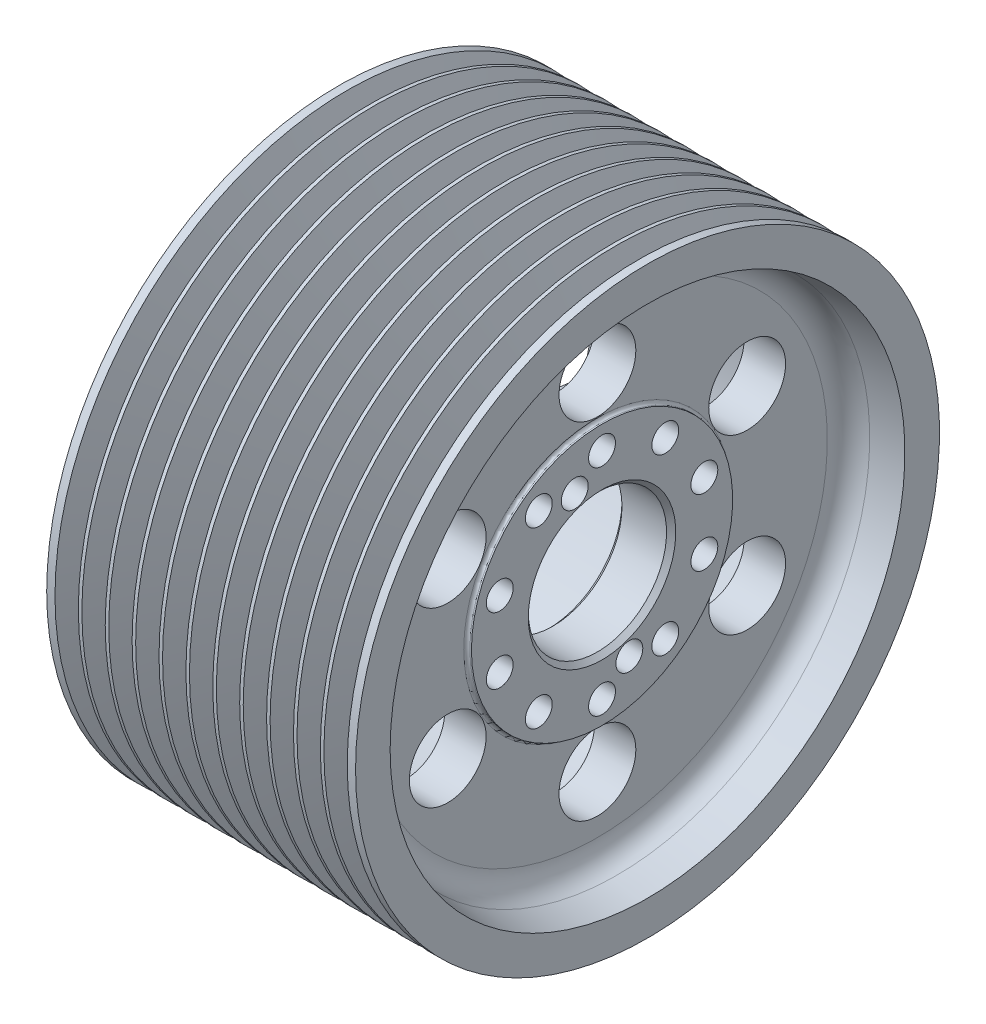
from build123d import *

# Parameters (mm, degrees)
LINEARES_MUSTER1_COUNT             = 11
LINEARES_MUSTER1_PITCH             = 17.5
F_17_5_17_5_DURCHMESSER_BOHRUNG1_D = 17.5
KREISMUSTER1_COUNT                 = 10
SCHNITT_LINEAR_AUSTRAGEN1_REACH    = 319.11
SKIZZE5_R                          = 25
KREISMUSTER2_COUNT                 = 6
FASE1_SIZE                         = 3
M16_GEWINDEBOHRUNG1_D              = 14
KREISMUSTER3_COUNT                 = 2
VERRUNDUNG1_R                      = 1


with BuildPart() as part:
    # Skizze1 → Rotation1 (revolve)
    with BuildSketch(Plane.XY, mode=Mode.PRIVATE) as rotation1_sk:
        with BuildLine():
            Line((0, 167.5), (0, 190))
            Line((0, 190), (201, 190))
            Line((201, 190), (201, 167.5))
            Line((201, 167.5), (181.12597769, 164.451837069))
            ThreePointArc((181.12597769, 164.451837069), (172.017769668, 159.394798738), (168.4, 149.625211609))
            Line((168.4, 149.625211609), (168.4, 87))
            ThreePointArc((168.4, 87), (168.985786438, 85.585786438), (170.4, 85))
            Line((170.4, 85), (171.4, 85))
            Line((171.4, 85), (171.4, 45))
            Line((171.4, 45), (136.4, 45))
            Line((136.4, 45), (136.4, 85))
            Line((136.4, 85), (139.4, 85))
            ThreePointArc((139.4, 85), (140.814213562, 85.585786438), (141.4, 87))
            Line((141.4, 87), (141.4, 147.953615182))
            ThreePointArc((141.4, 147.953615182), (137.168172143, 158.3961469), (126.86047084, 162.946545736))
            Line((126.86047084, 162.946545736), (60, 165))
            Line((60, 165), (60, 167.5))
            Line((60, 167.5), (0, 167.5))
        make_face()
    revolve(rotation1_sk.sketch.rotate(Axis((0, 0, 0), (1, 0, 0)), 90), axis=Axis((0, 0, 0), (1, 0, 0)))

    # Skizze2 → Schnitt-Rotation1 (revolve, cut)
    with BuildSketch(Plane.XY, mode=Mode.PRIVATE) as schnitt_rotation1_sk:
        Polygon((185.932347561, 174.8), (190.067652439, 174.8), (195.6, 190), (180.4, 190), align=None)
    schnitt_rotation1 = revolve(schnitt_rotation1_sk.sketch.rotate(Axis((0, 0, 0), (1, 0, 0)), 90), axis=Axis((0, 0, 0), (1, 0, 0)), mode=Mode.SUBTRACT)

    # Lineares Muster1: Schnitt-Rotation1 ×11
    with Locations(*[(-i * LINEARES_MUSTER1_PITCH, 0, 0) for i in range(1, LINEARES_MUSTER1_COUNT)]):
        add(schnitt_rotation1, mode=Mode.SUBTRACT)

    # 17.5 _17.5_ Durchmesser Bohrung1 (through all)
    with Locations(Plane(origin=(171.4, 0, 0), x_dir=(0, 0, -1), z_dir=(1, 0, 0))):
        with Locations((0, 70)):
            f_17_5_17_5_durchmesser_bohrung1 = Hole(F_17_5_17_5_DURCHMESSER_BOHRUNG1_D / 2)

    # Kreismuster1: 17.5 _17.5_ Durchmesser Bohrung1 ×10 about axis
    kreismuster1_axis = Axis((0, 0, 0), (-1, 0, 0))
    for i in range(1, KREISMUSTER1_COUNT):
        add(f_17_5_17_5_durchmesser_bohrung1.rotate(kreismuster1_axis, i * 360 / KREISMUSTER1_COUNT), mode=Mode.SUBTRACT)

    # Skizze5 → Schnitt-Linear austragen1 (cut, up to next)
    with BuildSketch(Plane(origin=(168.4, 0, 0), x_dir=(0, 0, -1), z_dir=(1, 0, 0)), mode=Mode.PRIVATE) as schnitt_linear_austragen1_sk1:
        with Locations((0, 112.5)):
            Circle(SKIZZE5_R)
    schnitt_linear_austragen1_tool1 = extrude(schnitt_linear_austragen1_sk1.sketch, amount=-SCHNITT_LINEAR_AUSTRAGEN1_REACH, mode=Mode.PRIVATE) & part.part
    schnitt_linear_austragen1 = schnitt_linear_austragen1_tool1.solids().sort_by_distance((168.4, 112.5, 0))[0]
    add(schnitt_linear_austragen1, mode=Mode.SUBTRACT)

    # Kreismuster2: Schnitt-Linear austragen1 ×6 about axis
    kreismuster2_axis = Axis((0, 0, 0), (-1, 0, 0))
    for i in range(1, KREISMUSTER2_COUNT):
        add(schnitt_linear_austragen1.rotate(kreismuster2_axis, i * 360 / KREISMUSTER2_COUNT), mode=Mode.SUBTRACT)

    # Fase1
    fase1_edges = [part.edges().sort_by_distance(p)[0] for p in [
        (136.4, 0, -45),
        (171.4, 0, -45),
    ]]
    chamfer(fase1_edges, length=FASE1_SIZE)

    # M16 Gewindebohrung1 (through all)
    with Locations(Plane(origin=(171.4, 0, 0), x_dir=(0, 0, -1), z_dir=(1, 0, 0))):
        with Locations((-17.768477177, 54.685749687)):
            m16_gewindebohrung1 = Hole(M16_GEWINDEBOHRUNG1_D / 2)

    # Skizze8 → 17.5 _17.5_ Durchmesser Bohrung2 (revolve, cut)
    with BuildSketch(Plane(origin=(171.4, 54.685749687, 17.768477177), x_dir=(0, 0, -1), z_dir=(0, 1, 0))):
        Polygon((0, 0), (0, 20.257530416), (8.75, 15), (8.75, 0), align=None)
    f_17_5_17_5_durchmesser_bohrung2 = revolve(axis=Axis((177.75, 54.685749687, 17.768477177), (-1, 0, 0)), mode=Mode.SUBTRACT)

    # Kreismuster3: M16 Gewindebohrung1, 17.5 _17.5_ Durchmesser Bohrung2 ×2 about axis
    kreismuster3_axis = Axis((0, 0, 0), (1, 0, 0))
    add([m16_gewindebohrung1.rotate(kreismuster3_axis, i * 360 / KREISMUSTER3_COUNT) for i in range(1, KREISMUSTER3_COUNT)], mode=Mode.SUBTRACT)
    add([f_17_5_17_5_durchmesser_bohrung2.rotate(kreismuster3_axis, i * 360 / KREISMUSTER3_COUNT) for i in range(1, KREISMUSTER3_COUNT)], mode=Mode.SUBTRACT)

    # Verrundung1
    verrundung1_edges = [part.edges().sort_by_distance(p)[0] for p in [
        (60, 0, -167.5),
    ]]
    fillet(verrundung1_edges, radius=VERRUNDUNG1_R)


solid = part.part
